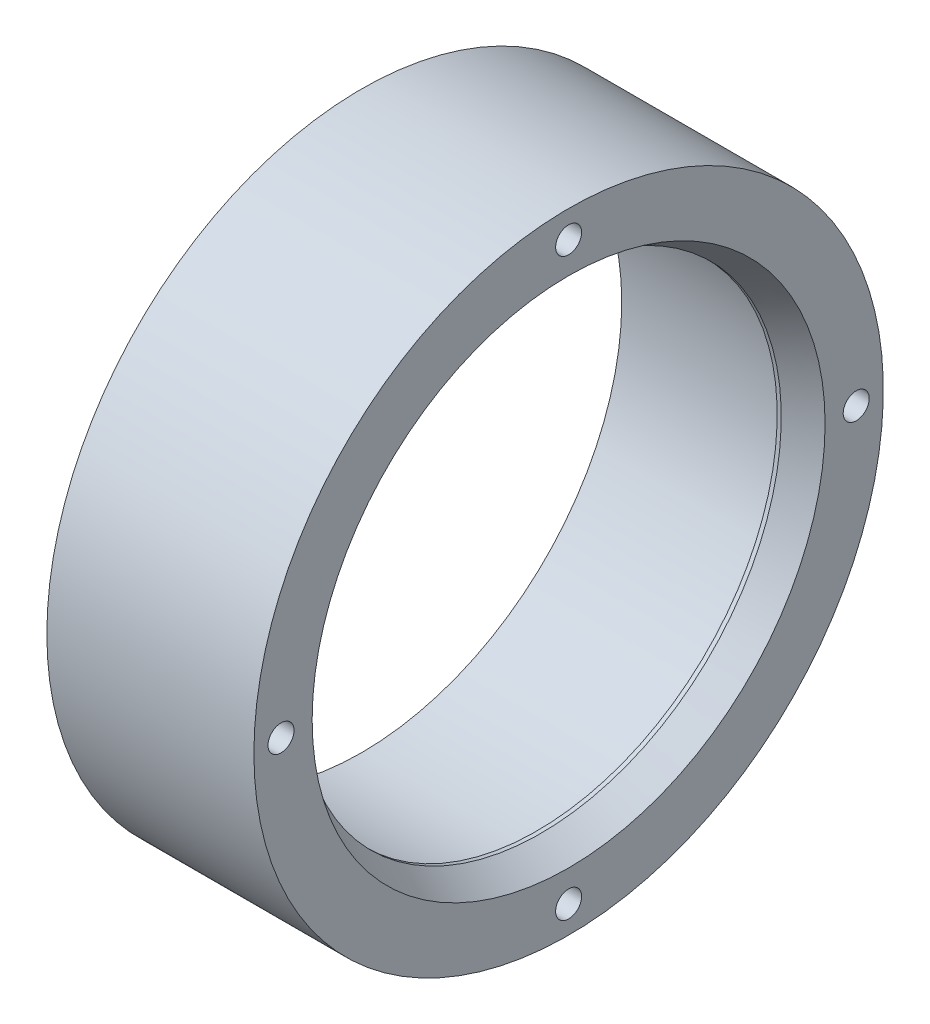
ISO-10303-21;
HEADER;
FILE_DESCRIPTION(('STEP AP214'),'2;1');
FILE_NAME('part.step','',(''),(''),'','','');
FILE_SCHEMA(('AUTOMOTIVE_DESIGN { 1 0 10303 214 1 1 1 1 }'));
ENDSEC;
DATA;
#1=APPLICATION_CONTEXT('core data for automotive mechanical design processes');
#2=APPLICATION_PROTOCOL_DEFINITION('international standard','automotive_design',2000,#1);
#3=PRODUCT_CONTEXT('',#1,'mechanical');
#4=PRODUCT('Part','Part','',(#3));
#5=PRODUCT_RELATED_PRODUCT_CATEGORY('part','',(#4));
#6=PRODUCT_DEFINITION_FORMATION('','',#4);
#7=PRODUCT_DEFINITION_CONTEXT('part definition',#1,'design');
#8=PRODUCT_DEFINITION('design','',#6,#7);
#9=PRODUCT_DEFINITION_SHAPE('','',#8);
#10=(LENGTH_UNIT() NAMED_UNIT(*) SI_UNIT(.MILLI.,.METRE.));
#11=(NAMED_UNIT(*) PLANE_ANGLE_UNIT() SI_UNIT($,.RADIAN.));
#12=(NAMED_UNIT(*) SI_UNIT($,.STERADIAN.) SOLID_ANGLE_UNIT());
#13=UNCERTAINTY_MEASURE_WITH_UNIT(LENGTH_MEASURE(1.E-05),#10,'distance_accuracy_value','');
#14=(GEOMETRIC_REPRESENTATION_CONTEXT(3) GLOBAL_UNCERTAINTY_ASSIGNED_CONTEXT((#13)) GLOBAL_UNIT_ASSIGNED_CONTEXT((#10,
#11,#12)) REPRESENTATION_CONTEXT('',''));
#15=CARTESIAN_POINT('',(0.,0.,0.));
#16=DIRECTION('',(0.,0.,1.));
#17=DIRECTION('',(1.,0.,0.));
#18=AXIS2_PLACEMENT_3D('',#15,#16,#17);
#19=CARTESIAN_POINT('',(25.4,51.8668,0.));
#20=DIRECTION('',(-1.,0.,0.));
#21=DIRECTION('',(0.,0.,1.));
#22=AXIS2_PLACEMENT_3D('',#19,#20,#21);
#23=PLANE('',#22);
#24=CARTESIAN_POINT('',(25.4,57.3278,3.86440331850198E-13));
#25=DIRECTION('',(1.,0.,0.));
#26=DIRECTION('',(0.,0.,1.));
#27=AXIS2_PLACEMENT_3D('',#24,#25,#26);
#28=CIRCLE('',#27,3.3782);
#29=CARTESIAN_POINT('',(25.4,57.3278,3.37820000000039));
#30=VERTEX_POINT('',#29);
#31=EDGE_CURVE('E88',#30,#30,#28,.T.);
#32=ORIENTED_EDGE('',*,*,#31,.T.);
#33=EDGE_LOOP('',(#32));
#34=FACE_BOUND('',#33,.T.);
#35=CARTESIAN_POINT('',(25.4,-57.3278,0.));
#36=DIRECTION('',(1.,0.,0.));
#37=DIRECTION('',(0.,0.,-1.));
#38=AXIS2_PLACEMENT_3D('',#35,#36,#37);
#39=CIRCLE('',#38,3.3782);
#40=CARTESIAN_POINT('',(25.4,-57.3278,-3.37819999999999));
#41=VERTEX_POINT('',#40);
#42=EDGE_CURVE('E70',#41,#41,#39,.T.);
#43=ORIENTED_EDGE('',*,*,#42,.T.);
#44=EDGE_LOOP('',(#43));
#45=FACE_BOUND('',#44,.T.);
#46=CARTESIAN_POINT('',(25.4,0.,0.));
#47=DIRECTION('',(-1.,0.,0.));
#48=DIRECTION('',(0.,0.,1.));
#49=AXIS2_PLACEMENT_3D('',#46,#47,#48);
#50=CIRCLE('',#49,62.738);
#51=CARTESIAN_POINT('',(25.4,0.,62.738));
#52=VERTEX_POINT('',#51);
#53=EDGE_CURVE('E61',#52,#52,#50,.T.);
#54=ORIENTED_EDGE('',*,*,#53,.T.);
#55=EDGE_LOOP('',(#54));
#56=FACE_BOUND('',#55,.T.);
#57=CARTESIAN_POINT('',(25.4,0.,0.));
#58=DIRECTION('',(-1.,0.,0.));
#59=DIRECTION('',(0.,0.,1.));
#60=AXIS2_PLACEMENT_3D('',#57,#58,#59);
#61=CIRCLE('',#60,51.8668);
#62=CARTESIAN_POINT('',(25.4,0.,51.8668));
#63=VERTEX_POINT('',#62);
#64=EDGE_CURVE('E64',#63,#63,#61,.T.);
#65=ORIENTED_EDGE('',*,*,#64,.F.);
#66=EDGE_LOOP('',(#65));
#67=FACE_BOUND('',#66,.T.);
#68=CARTESIAN_POINT('',(25.4,1.86281272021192E-13,-57.3278));
#69=DIRECTION('',(1.,0.,0.));
#70=DIRECTION('',(0.,1.,0.));
#71=AXIS2_PLACEMENT_3D('',#68,#69,#70);
#72=CIRCLE('',#71,3.3782);
#73=CARTESIAN_POINT('',(25.4,3.37820000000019,-57.3278));
#74=VERTEX_POINT('',#73);
#75=EDGE_CURVE('E82',#74,#74,#72,.T.);
#76=ORIENTED_EDGE('',*,*,#75,.T.);
#77=EDGE_LOOP('',(#76));
#78=FACE_BOUND('',#77,.T.);
#79=CARTESIAN_POINT('',(25.4,-5.86599391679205E-13,57.3278));
#80=DIRECTION('',(1.,0.,0.));
#81=DIRECTION('',(0.,-1.,0.));
#82=AXIS2_PLACEMENT_3D('',#79,#80,#81);
#83=CIRCLE('',#82,3.3782);
#84=CARTESIAN_POINT('',(25.4,-3.37820000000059,57.3277999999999));
#85=VERTEX_POINT('',#84);
#86=EDGE_CURVE('E94',#85,#85,#83,.T.);
#87=ORIENTED_EDGE('',*,*,#86,.T.);
#88=EDGE_LOOP('',(#87));
#89=FACE_BOUND('',#88,.T.);
#90=ADVANCED_FACE('F35',(#34,#45,#56,#67,#78,#89),#23,.T.);
#91=CARTESIAN_POINT('',(-62.3058449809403,0.,0.));
#92=DIRECTION('',(-1.,0.,0.));
#93=DIRECTION('',(0.,0.,1.));
#94=AXIS2_PLACEMENT_3D('',#91,#92,#93);
#95=CYLINDRICAL_SURFACE('',#94,51.8668);
#96=ORIENTED_EDGE('',*,*,#64,.T.);
#97=EDGE_LOOP('',(#96));
#98=FACE_BOUND('',#97,.T.);
#99=CARTESIAN_POINT('',(59.563,0.,0.));
#100=DIRECTION('',(-1.,0.,0.));
#101=DIRECTION('',(0.,0.,1.));
#102=AXIS2_PLACEMENT_3D('',#99,#100,#101);
#103=CIRCLE('',#102,51.8668);
#104=CARTESIAN_POINT('',(59.563,0.,51.8668));
#105=VERTEX_POINT('',#104);
#106=EDGE_CURVE('E10',#105,#105,#103,.T.);
#107=ORIENTED_EDGE('',*,*,#106,.F.);
#108=EDGE_LOOP('',(#107));
#109=FACE_BOUND('',#108,.T.);
#110=ADVANCED_FACE('F37',(#98,#109),#95,.F.);
#111=CARTESIAN_POINT('',(59.563,0.,0.));
#112=DIRECTION('',(-1.,0.,0.));
#113=DIRECTION('',(0.,0.,1.));
#114=AXIS2_PLACEMENT_3D('',#111,#112,#113);
#115=TOROIDAL_SURFACE('',#114,51.1048,0.761999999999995);
#116=ORIENTED_EDGE('',*,*,#106,.T.);
#117=EDGE_LOOP('',(#116));
#118=FACE_BOUND('',#117,.T.);
#119=CARTESIAN_POINT('',(60.325,0.,0.));
#120=DIRECTION('',(-1.,0.,0.));
#121=DIRECTION('',(0.,0.,1.));
#122=AXIS2_PLACEMENT_3D('',#119,#120,#121);
#123=CIRCLE('',#122,51.1048);
#124=CARTESIAN_POINT('',(60.325,0.,51.1048));
#125=VERTEX_POINT('',#124);
#126=EDGE_CURVE('E42',#125,#125,#123,.T.);
#127=ORIENTED_EDGE('',*,*,#126,.F.);
#128=EDGE_LOOP('',(#127));
#129=FACE_BOUND('',#128,.T.);
#130=ADVANCED_FACE('F139',(#118,#129),#115,.F.);
#131=CARTESIAN_POINT('',(60.325,51.1048,0.));
#132=DIRECTION('',(1.,0.,0.));
#133=DIRECTION('',(0.,0.,-1.));
#134=AXIS2_PLACEMENT_3D('',#131,#132,#133);
#135=PLANE('',#134);
#136=CARTESIAN_POINT('',(60.325,0.,0.));
#137=DIRECTION('',(-1.,0.,0.));
#138=DIRECTION('',(0.,0.,1.));
#139=AXIS2_PLACEMENT_3D('',#136,#137,#138);
#140=CIRCLE('',#139,47.9298);
#141=CARTESIAN_POINT('',(60.325,0.,47.9298));
#142=VERTEX_POINT('',#141);
#143=EDGE_CURVE('E46',#142,#142,#140,.T.);
#144=ORIENTED_EDGE('',*,*,#143,.F.);
#145=EDGE_LOOP('',(#144));
#146=FACE_BOUND('',#145,.T.);
#147=ORIENTED_EDGE('',*,*,#126,.T.);
#148=EDGE_LOOP('',(#147));
#149=FACE_BOUND('',#148,.T.);
#150=ADVANCED_FACE('F162',(#146,#149),#135,.F.);
#151=CARTESIAN_POINT('',(-62.3058449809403,0.,0.));
#152=DIRECTION('',(-1.,0.,0.));
#153=DIRECTION('',(0.,0.,1.));
#154=AXIS2_PLACEMENT_3D('',#151,#152,#153);
#155=CYLINDRICAL_SURFACE('',#154,47.9298);
#156=CARTESIAN_POINT('',(61.1378,0.,0.));
#157=DIRECTION('',(-1.,0.,0.));
#158=DIRECTION('',(0.,0.,1.));
#159=AXIS2_PLACEMENT_3D('',#156,#157,#158);
#160=CIRCLE('',#159,47.9298);
#161=CARTESIAN_POINT('',(61.1378,0.,47.9298));
#162=VERTEX_POINT('',#161);
#163=EDGE_CURVE('E50',#162,#162,#160,.T.);
#164=ORIENTED_EDGE('',*,*,#163,.F.);
#165=EDGE_LOOP('',(#164));
#166=FACE_BOUND('',#165,.T.);
#167=ORIENTED_EDGE('',*,*,#143,.T.);
#168=EDGE_LOOP('',(#167));
#169=FACE_BOUND('',#168,.T.);
#170=ADVANCED_FACE('F158',(#166,#169),#155,.F.);
#171=CARTESIAN_POINT('',(61.1378,0.,0.));
#172=DIRECTION('',(1.,0.,0.));
#173=DIRECTION('',(0.,0.,-1.));
#174=AXIS2_PLACEMENT_3D('',#171,#172,#173);
#175=CONICAL_SURFACE('',#174,47.9298,0.5235987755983);
#176=CARTESIAN_POINT('',(66.675,0.,0.));
#177=DIRECTION('',(-1.,0.,0.));
#178=DIRECTION('',(0.,0.,1.));
#179=AXIS2_PLACEMENT_3D('',#176,#177,#178);
#180=CIRCLE('',#179,51.1267039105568);
#181=CARTESIAN_POINT('',(66.675,0.,51.1267039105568));
#182=VERTEX_POINT('',#181);
#183=EDGE_CURVE('E55',#182,#182,#180,.T.);
#184=ORIENTED_EDGE('',*,*,#183,.F.);
#185=EDGE_LOOP('',(#184));
#186=FACE_BOUND('',#185,.T.);
#187=ORIENTED_EDGE('',*,*,#163,.T.);
#188=EDGE_LOOP('',(#187));
#189=FACE_BOUND('',#188,.T.);
#190=ADVANCED_FACE('F154',(#186,#189),#175,.F.);
#191=CARTESIAN_POINT('',(66.675,51.1267039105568,0.));
#192=DIRECTION('',(-1.,0.,0.));
#193=DIRECTION('',(0.,0.,1.));
#194=AXIS2_PLACEMENT_3D('',#191,#192,#193);
#195=PLANE('',#194);
#196=CARTESIAN_POINT('',(66.675,-5.86599391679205E-13,57.3278));
#197=DIRECTION('',(-1.,0.,0.));
#198=DIRECTION('',(0.,1.,0.));
#199=AXIS2_PLACEMENT_3D('',#196,#197,#198);
#200=CIRCLE('',#199,2.5908);
#201=CARTESIAN_POINT('',(66.675,2.59079999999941,57.3278));
#202=VERTEX_POINT('',#201);
#203=EDGE_CURVE('E109',#202,#202,#200,.T.);
#204=ORIENTED_EDGE('',*,*,#203,.T.);
#205=EDGE_LOOP('',(#204));
#206=FACE_BOUND('',#205,.T.);
#207=CARTESIAN_POINT('',(66.675,57.3278,3.86440331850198E-13));
#208=DIRECTION('',(-1.,0.,0.));
#209=DIRECTION('',(0.,0.,-1.));
#210=AXIS2_PLACEMENT_3D('',#207,#208,#209);
#211=CIRCLE('',#210,2.5908);
#212=CARTESIAN_POINT('',(66.675,57.3278,-2.59079999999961));
#213=VERTEX_POINT('',#212);
#214=EDGE_CURVE('E103',#213,#213,#211,.T.);
#215=ORIENTED_EDGE('',*,*,#214,.T.);
#216=EDGE_LOOP('',(#215));
#217=FACE_BOUND('',#216,.T.);
#218=CARTESIAN_POINT('',(66.675,1.86281272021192E-13,-57.3278));
#219=DIRECTION('',(-1.,0.,0.));
#220=DIRECTION('',(0.,-1.,0.));
#221=AXIS2_PLACEMENT_3D('',#218,#219,#220);
#222=CIRCLE('',#221,2.5908);
#223=CARTESIAN_POINT('',(66.675,-2.59079999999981,-57.3278));
#224=VERTEX_POINT('',#223);
#225=EDGE_CURVE('E97',#224,#224,#222,.T.);
#226=ORIENTED_EDGE('',*,*,#225,.T.);
#227=EDGE_LOOP('',(#226));
#228=FACE_BOUND('',#227,.T.);
#229=CARTESIAN_POINT('',(66.675,-57.3278,0.));
#230=DIRECTION('',(-1.,0.,0.));
#231=DIRECTION('',(0.,0.,1.));
#232=AXIS2_PLACEMENT_3D('',#229,#230,#231);
#233=CIRCLE('',#232,2.5908);
#234=CARTESIAN_POINT('',(66.675,-57.3278,2.59080000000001));
#235=VERTEX_POINT('',#234);
#236=EDGE_CURVE('E73',#235,#235,#233,.T.);
#237=ORIENTED_EDGE('',*,*,#236,.T.);
#238=EDGE_LOOP('',(#237));
#239=FACE_BOUND('',#238,.T.);
#240=CARTESIAN_POINT('',(66.675,0.,0.));
#241=DIRECTION('',(-1.,0.,0.));
#242=DIRECTION('',(0.,0.,1.));
#243=AXIS2_PLACEMENT_3D('',#240,#241,#242);
#244=CIRCLE('',#243,62.738);
#245=CARTESIAN_POINT('',(66.675,0.,62.738));
#246=VERTEX_POINT('',#245);
#247=EDGE_CURVE('E58',#246,#246,#244,.T.);
#248=ORIENTED_EDGE('',*,*,#247,.F.);
#249=EDGE_LOOP('',(#248));
#250=FACE_BOUND('',#249,.T.);
#251=ORIENTED_EDGE('',*,*,#183,.T.);
#252=EDGE_LOOP('',(#251));
#253=FACE_BOUND('',#252,.T.);
#254=ADVANCED_FACE('F149',(#206,#217,#228,#239,#250,#253),#195,.F.);
#255=CARTESIAN_POINT('',(-62.3058449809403,0.,0.));
#256=DIRECTION('',(-1.,0.,0.));
#257=DIRECTION('',(0.,0.,1.));
#258=AXIS2_PLACEMENT_3D('',#255,#256,#257);
#259=CYLINDRICAL_SURFACE('',#258,62.738);
#260=ORIENTED_EDGE('',*,*,#247,.T.);
#261=EDGE_LOOP('',(#260));
#262=FACE_BOUND('',#261,.T.);
#263=ORIENTED_EDGE('',*,*,#53,.F.);
#264=EDGE_LOOP('',(#263));
#265=FACE_BOUND('',#264,.T.);
#266=ADVANCED_FACE('F146',(#262,#265),#259,.T.);
#267=CARTESIAN_POINT('',(53.34,-57.3278,0.));
#268=DIRECTION('',(-1.,0.,0.));
#269=DIRECTION('',(0.,0.,1.));
#270=AXIS2_PLACEMENT_3D('',#267,#268,#269);
#271=CYLINDRICAL_SURFACE('',#270,3.3782);
#272=CARTESIAN_POINT('',(53.34,-57.3278,0.));
#273=DIRECTION('',(1.,0.,0.));
#274=DIRECTION('',(0.,0.,-1.));
#275=AXIS2_PLACEMENT_3D('',#272,#273,#274);
#276=CIRCLE('',#275,3.3782);
#277=CARTESIAN_POINT('',(53.34,-57.3278,-3.37819999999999));
#278=VERTEX_POINT('',#277);
#279=EDGE_CURVE('E67',#278,#278,#276,.T.);
#280=ORIENTED_EDGE('',*,*,#279,.T.);
#281=EDGE_LOOP('',(#280));
#282=FACE_BOUND('',#281,.T.);
#283=ORIENTED_EDGE('',*,*,#42,.F.);
#284=EDGE_LOOP('',(#283));
#285=FACE_BOUND('',#284,.T.);
#286=ADVANCED_FACE('F144',(#282,#285),#271,.F.);
#287=CARTESIAN_POINT('',(53.34,-57.3278,0.));
#288=DIRECTION('',(1.,0.,0.));
#289=DIRECTION('',(0.,0.,-1.));
#290=AXIS2_PLACEMENT_3D('',#287,#288,#289);
#291=PLANE('',#290);
#292=CARTESIAN_POINT('',(53.34,-57.3278,0.));
#293=DIRECTION('',(-1.,0.,0.));
#294=DIRECTION('',(0.,0.,1.));
#295=AXIS2_PLACEMENT_3D('',#292,#293,#294);
#296=CIRCLE('',#295,2.5908);
#297=CARTESIAN_POINT('',(53.34,-57.3278,2.59080000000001));
#298=VERTEX_POINT('',#297);
#299=EDGE_CURVE('E76',#298,#298,#296,.T.);
#300=ORIENTED_EDGE('',*,*,#299,.F.);
#301=EDGE_LOOP('',(#300));
#302=FACE_BOUND('',#301,.T.);
#303=ORIENTED_EDGE('',*,*,#279,.F.);
#304=EDGE_LOOP('',(#303));
#305=FACE_BOUND('',#304,.T.);
#306=ADVANCED_FACE('F151',(#302,#305),#291,.F.);
#307=CARTESIAN_POINT('',(66.675,-57.3278,0.));
#308=DIRECTION('',(-1.,0.,0.));
#309=DIRECTION('',(0.,0.,1.));
#310=AXIS2_PLACEMENT_3D('',#307,#308,#309);
#311=CYLINDRICAL_SURFACE('',#310,2.5908);
#312=ORIENTED_EDGE('',*,*,#236,.F.);
#313=EDGE_LOOP('',(#312));
#314=FACE_BOUND('',#313,.T.);
#315=ORIENTED_EDGE('',*,*,#299,.T.);
#316=EDGE_LOOP('',(#315));
#317=FACE_BOUND('',#316,.T.);
#318=ADVANCED_FACE('F199',(#314,#317),#311,.F.);
#319=CARTESIAN_POINT('',(53.34,1.86281272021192E-13,-57.3278));
#320=DIRECTION('',(-1.,0.,0.));
#321=DIRECTION('',(0.,0.,1.));
#322=AXIS2_PLACEMENT_3D('',#319,#320,#321);
#323=CYLINDRICAL_SURFACE('',#322,3.3782);
#324=CARTESIAN_POINT('',(53.34,1.86281272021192E-13,-57.3278));
#325=DIRECTION('',(1.,0.,0.));
#326=DIRECTION('',(0.,1.,0.));
#327=AXIS2_PLACEMENT_3D('',#324,#325,#326);
#328=CIRCLE('',#327,3.3782);
#329=CARTESIAN_POINT('',(53.34,3.37820000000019,-57.3278));
#330=VERTEX_POINT('',#329);
#331=EDGE_CURVE('E79',#330,#330,#328,.T.);
#332=ORIENTED_EDGE('',*,*,#331,.T.);
#333=EDGE_LOOP('',(#332));
#334=FACE_BOUND('',#333,.T.);
#335=ORIENTED_EDGE('',*,*,#75,.F.);
#336=EDGE_LOOP('',(#335));
#337=FACE_BOUND('',#336,.T.);
#338=ADVANCED_FACE('F211',(#334,#337),#323,.F.);
#339=CARTESIAN_POINT('',(53.34,1.86281272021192E-13,-57.3278));
#340=DIRECTION('',(1.,0.,0.));
#341=DIRECTION('',(0.,1.,0.));
#342=AXIS2_PLACEMENT_3D('',#339,#340,#341);
#343=PLANE('',#342);
#344=CARTESIAN_POINT('',(53.34,1.86281272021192E-13,-57.3278));
#345=DIRECTION('',(-1.,0.,0.));
#346=DIRECTION('',(0.,-1.,0.));
#347=AXIS2_PLACEMENT_3D('',#344,#345,#346);
#348=CIRCLE('',#347,2.5908);
#349=CARTESIAN_POINT('',(53.34,-2.59079999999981,-57.3278));
#350=VERTEX_POINT('',#349);
#351=EDGE_CURVE('E100',#350,#350,#348,.T.);
#352=ORIENTED_EDGE('',*,*,#351,.F.);
#353=EDGE_LOOP('',(#352));
#354=FACE_BOUND('',#353,.T.);
#355=ORIENTED_EDGE('',*,*,#331,.F.);
#356=EDGE_LOOP('',(#355));
#357=FACE_BOUND('',#356,.T.);
#358=ADVANCED_FACE('F214',(#354,#357),#343,.F.);
#359=CARTESIAN_POINT('',(53.34,57.3278,3.86440331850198E-13));
#360=DIRECTION('',(-1.,0.,0.));
#361=DIRECTION('',(0.,0.,1.));
#362=AXIS2_PLACEMENT_3D('',#359,#360,#361);
#363=CYLINDRICAL_SURFACE('',#362,3.3782);
#364=CARTESIAN_POINT('',(53.34,57.3278,3.86440331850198E-13));
#365=DIRECTION('',(1.,0.,0.));
#366=DIRECTION('',(0.,0.,1.));
#367=AXIS2_PLACEMENT_3D('',#364,#365,#366);
#368=CIRCLE('',#367,3.3782);
#369=CARTESIAN_POINT('',(53.34,57.3278,3.37820000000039));
#370=VERTEX_POINT('',#369);
#371=EDGE_CURVE('E85',#370,#370,#368,.T.);
#372=ORIENTED_EDGE('',*,*,#371,.T.);
#373=EDGE_LOOP('',(#372));
#374=FACE_BOUND('',#373,.T.);
#375=ORIENTED_EDGE('',*,*,#31,.F.);
#376=EDGE_LOOP('',(#375));
#377=FACE_BOUND('',#376,.T.);
#378=ADVANCED_FACE('F124',(#374,#377),#363,.F.);
#379=CARTESIAN_POINT('',(53.34,57.3278,3.86440331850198E-13));
#380=DIRECTION('',(1.,0.,0.));
#381=DIRECTION('',(0.,0.,1.));
#382=AXIS2_PLACEMENT_3D('',#379,#380,#381);
#383=PLANE('',#382);
#384=CARTESIAN_POINT('',(53.34,57.3278,3.86440331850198E-13));
#385=DIRECTION('',(-1.,0.,0.));
#386=DIRECTION('',(0.,0.,-1.));
#387=AXIS2_PLACEMENT_3D('',#384,#385,#386);
#388=CIRCLE('',#387,2.5908);
#389=CARTESIAN_POINT('',(53.34,57.3278,-2.59079999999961));
#390=VERTEX_POINT('',#389);
#391=EDGE_CURVE('E106',#390,#390,#388,.T.);
#392=ORIENTED_EDGE('',*,*,#391,.F.);
#393=EDGE_LOOP('',(#392));
#394=FACE_BOUND('',#393,.T.);
#395=ORIENTED_EDGE('',*,*,#371,.F.);
#396=EDGE_LOOP('',(#395));
#397=FACE_BOUND('',#396,.T.);
#398=ADVANCED_FACE('F129',(#394,#397),#383,.F.);
#399=CARTESIAN_POINT('',(53.34,-5.86599391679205E-13,57.3278));
#400=DIRECTION('',(-1.,0.,0.));
#401=DIRECTION('',(0.,0.,1.));
#402=AXIS2_PLACEMENT_3D('',#399,#400,#401);
#403=CYLINDRICAL_SURFACE('',#402,3.3782);
#404=CARTESIAN_POINT('',(53.34,-5.86599391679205E-13,57.3278));
#405=DIRECTION('',(1.,0.,0.));
#406=DIRECTION('',(0.,-1.,0.));
#407=AXIS2_PLACEMENT_3D('',#404,#405,#406);
#408=CIRCLE('',#407,3.3782);
#409=CARTESIAN_POINT('',(53.34,-3.37820000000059,57.3277999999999));
#410=VERTEX_POINT('',#409);
#411=EDGE_CURVE('E91',#410,#410,#408,.T.);
#412=ORIENTED_EDGE('',*,*,#411,.T.);
#413=EDGE_LOOP('',(#412));
#414=FACE_BOUND('',#413,.T.);
#415=ORIENTED_EDGE('',*,*,#86,.F.);
#416=EDGE_LOOP('',(#415));
#417=FACE_BOUND('',#416,.T.);
#418=ADVANCED_FACE('F122',(#414,#417),#403,.F.);
#419=CARTESIAN_POINT('',(53.34,-5.86599391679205E-13,57.3278));
#420=DIRECTION('',(1.,0.,0.));
#421=DIRECTION('',(0.,-1.,0.));
#422=AXIS2_PLACEMENT_3D('',#419,#420,#421);
#423=PLANE('',#422);
#424=CARTESIAN_POINT('',(53.34,-5.86599391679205E-13,57.3278));
#425=DIRECTION('',(-1.,0.,0.));
#426=DIRECTION('',(0.,1.,0.));
#427=AXIS2_PLACEMENT_3D('',#424,#425,#426);
#428=CIRCLE('',#427,2.5908);
#429=CARTESIAN_POINT('',(53.34,2.59079999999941,57.3278));
#430=VERTEX_POINT('',#429);
#431=EDGE_CURVE('E112',#430,#430,#428,.T.);
#432=ORIENTED_EDGE('',*,*,#431,.F.);
#433=EDGE_LOOP('',(#432));
#434=FACE_BOUND('',#433,.T.);
#435=ORIENTED_EDGE('',*,*,#411,.F.);
#436=EDGE_LOOP('',(#435));
#437=FACE_BOUND('',#436,.T.);
#438=ADVANCED_FACE('F118',(#434,#437),#423,.F.);
#439=CARTESIAN_POINT('',(66.675,1.86281272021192E-13,-57.3278));
#440=DIRECTION('',(-1.,0.,0.));
#441=DIRECTION('',(0.,0.,1.));
#442=AXIS2_PLACEMENT_3D('',#439,#440,#441);
#443=CYLINDRICAL_SURFACE('',#442,2.5908);
#444=ORIENTED_EDGE('',*,*,#225,.F.);
#445=EDGE_LOOP('',(#444));
#446=FACE_BOUND('',#445,.T.);
#447=ORIENTED_EDGE('',*,*,#351,.T.);
#448=EDGE_LOOP('',(#447));
#449=FACE_BOUND('',#448,.T.);
#450=ADVANCED_FACE('F121',(#446,#449),#443,.F.);
#451=CARTESIAN_POINT('',(66.675,57.3278,3.86440331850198E-13));
#452=DIRECTION('',(-1.,0.,0.));
#453=DIRECTION('',(0.,0.,1.));
#454=AXIS2_PLACEMENT_3D('',#451,#452,#453);
#455=CYLINDRICAL_SURFACE('',#454,2.5908);
#456=ORIENTED_EDGE('',*,*,#214,.F.);
#457=EDGE_LOOP('',(#456));
#458=FACE_BOUND('',#457,.T.);
#459=ORIENTED_EDGE('',*,*,#391,.T.);
#460=EDGE_LOOP('',(#459));
#461=FACE_BOUND('',#460,.T.);
#462=ADVANCED_FACE('F256',(#458,#461),#455,.F.);
#463=CARTESIAN_POINT('',(66.675,-5.86599391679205E-13,57.3278));
#464=DIRECTION('',(-1.,0.,0.));
#465=DIRECTION('',(0.,0.,1.));
#466=AXIS2_PLACEMENT_3D('',#463,#464,#465);
#467=CYLINDRICAL_SURFACE('',#466,2.5908);
#468=ORIENTED_EDGE('',*,*,#203,.F.);
#469=EDGE_LOOP('',(#468));
#470=FACE_BOUND('',#469,.T.);
#471=ORIENTED_EDGE('',*,*,#431,.T.);
#472=EDGE_LOOP('',(#471));
#473=FACE_BOUND('',#472,.T.);
#474=ADVANCED_FACE('F116',(#470,#473),#467,.F.);
#475=CLOSED_SHELL('',(#90,#110,#130,#150,#170,#190,#254,#266,#286,#306,#318,#338,#358,#378,#398,
#418,#438,#450,#462,#474));
#476=MANIFOLD_SOLID_BREP('B2',#475);
#477=ADVANCED_BREP_SHAPE_REPRESENTATION('',(#18,#476),#14);
#478=SHAPE_DEFINITION_REPRESENTATION(#9,#477);
ENDSEC;
END-ISO-10303-21;
